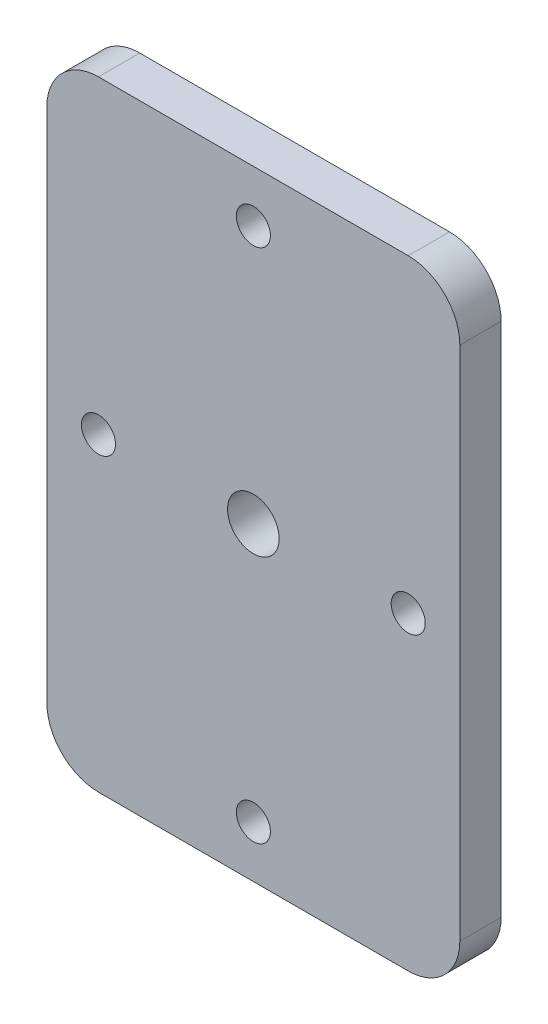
ISO-10303-21;
HEADER;
FILE_DESCRIPTION(('STEP AP214'),'2;1');
FILE_NAME('part.step','',(''),(''),'','','');
FILE_SCHEMA(('AUTOMOTIVE_DESIGN { 1 0 10303 214 1 1 1 1 }'));
ENDSEC;
DATA;
#1=APPLICATION_CONTEXT('core data for automotive mechanical design processes');
#2=APPLICATION_PROTOCOL_DEFINITION('international standard','automotive_design',2000,#1);
#3=PRODUCT_CONTEXT('',#1,'mechanical');
#4=PRODUCT('Part','Part','',(#3));
#5=PRODUCT_RELATED_PRODUCT_CATEGORY('part','',(#4));
#6=PRODUCT_DEFINITION_FORMATION('','',#4);
#7=PRODUCT_DEFINITION_CONTEXT('part definition',#1,'design');
#8=PRODUCT_DEFINITION('design','',#6,#7);
#9=PRODUCT_DEFINITION_SHAPE('','',#8);
#10=(LENGTH_UNIT() NAMED_UNIT(*) SI_UNIT(.MILLI.,.METRE.));
#11=(NAMED_UNIT(*) PLANE_ANGLE_UNIT() SI_UNIT($,.RADIAN.));
#12=(NAMED_UNIT(*) SI_UNIT($,.STERADIAN.) SOLID_ANGLE_UNIT());
#13=UNCERTAINTY_MEASURE_WITH_UNIT(LENGTH_MEASURE(1.E-05),#10,'distance_accuracy_value','');
#14=(GEOMETRIC_REPRESENTATION_CONTEXT(3) GLOBAL_UNCERTAINTY_ASSIGNED_CONTEXT((#13)) GLOBAL_UNIT_ASSIGNED_CONTEXT((#10,
#11,#12)) REPRESENTATION_CONTEXT('',''));
#15=CARTESIAN_POINT('',(0.,0.,0.));
#16=DIRECTION('',(0.,0.,1.));
#17=DIRECTION('',(1.,0.,0.));
#18=AXIS2_PLACEMENT_3D('',#15,#16,#17);
#19=CARTESIAN_POINT('',(40.,25.,4.));
#20=DIRECTION('',(0.,0.,-1.));
#21=DIRECTION('',(-1.,0.,0.));
#22=AXIS2_PLACEMENT_3D('',#19,#20,#21);
#23=CYLINDRICAL_SURFACE('',#22,5.);
#24=CARTESIAN_POINT('',(40.,25.,0.));
#25=DIRECTION('',(0.,0.,1.));
#26=DIRECTION('',(1.,0.,0.));
#27=AXIS2_PLACEMENT_3D('',#24,#25,#26);
#28=CIRCLE('',#27,5.);
#29=CARTESIAN_POINT('',(45.,25.,0.));
#30=VERTEX_POINT('',#29);
#31=CARTESIAN_POINT('',(40.,30.,0.));
#32=VERTEX_POINT('',#31);
#33=EDGE_CURVE('E127',#30,#32,#28,.T.);
#34=ORIENTED_EDGE('',*,*,#33,.T.);
#35=DIRECTION('',(0.,0.,-1.));
#36=VECTOR('',#35,1.);
#37=CARTESIAN_POINT('',(40.,30.,4.));
#38=LINE('',#37,#36);
#39=CARTESIAN_POINT('',(40.,30.,4.));
#40=VERTEX_POINT('',#39);
#41=EDGE_CURVE('E11',#40,#32,#38,.T.);
#42=ORIENTED_EDGE('',*,*,#41,.F.);
#43=CARTESIAN_POINT('',(40.,25.,4.));
#44=DIRECTION('',(0.,0.,1.));
#45=DIRECTION('',(1.,0.,0.));
#46=AXIS2_PLACEMENT_3D('',#43,#44,#45);
#47=CIRCLE('',#46,5.);
#48=CARTESIAN_POINT('',(45.,25.,4.));
#49=VERTEX_POINT('',#48);
#50=EDGE_CURVE('E142',#49,#40,#47,.T.);
#51=ORIENTED_EDGE('',*,*,#50,.F.);
#52=DIRECTION('',(0.,0.,-1.));
#53=VECTOR('',#52,1.);
#54=CARTESIAN_POINT('',(45.,25.,4.));
#55=LINE('',#54,#53);
#56=EDGE_CURVE('E123',#49,#30,#55,.T.);
#57=ORIENTED_EDGE('',*,*,#56,.T.);
#58=EDGE_LOOP('',(#34,#42,#51,#57));
#59=FACE_BOUND('',#58,.T.);
#60=ADVANCED_FACE('F31',(#59),#23,.T.);
#61=CARTESIAN_POINT('',(40.,30.,4.));
#62=DIRECTION('',(0.,-1.,0.));
#63=DIRECTION('',(0.,0.,-1.));
#64=AXIS2_PLACEMENT_3D('',#61,#62,#63);
#65=PLANE('',#64);
#66=DIRECTION('',(-1.,0.,0.));
#67=VECTOR('',#66,1.);
#68=CARTESIAN_POINT('',(40.,30.,0.));
#69=LINE('',#68,#67);
#70=CARTESIAN_POINT('',(10.,30.,0.));
#71=VERTEX_POINT('',#70);
#72=EDGE_CURVE('E130',#32,#71,#69,.T.);
#73=ORIENTED_EDGE('',*,*,#72,.T.);
#74=DIRECTION('',(0.,0.,-1.));
#75=VECTOR('',#74,1.);
#76=CARTESIAN_POINT('',(10.,30.,4.));
#77=LINE('',#76,#75);
#78=CARTESIAN_POINT('',(10.,30.,4.));
#79=VERTEX_POINT('',#78);
#80=EDGE_CURVE('E39',#79,#71,#77,.T.);
#81=ORIENTED_EDGE('',*,*,#80,.F.);
#82=DIRECTION('',(-1.,0.,0.));
#83=VECTOR('',#82,1.);
#84=CARTESIAN_POINT('',(40.,30.,4.));
#85=LINE('',#84,#83);
#86=EDGE_CURVE('E90',#40,#79,#85,.T.);
#87=ORIENTED_EDGE('',*,*,#86,.F.);
#88=ORIENTED_EDGE('',*,*,#41,.T.);
#89=EDGE_LOOP('',(#73,#81,#87,#88));
#90=FACE_BOUND('',#89,.T.);
#91=ADVANCED_FACE('F235',(#90),#65,.F.);
#92=CARTESIAN_POINT('',(10.,25.,4.));
#93=DIRECTION('',(0.,0.,-1.));
#94=DIRECTION('',(-1.,0.,0.));
#95=AXIS2_PLACEMENT_3D('',#92,#93,#94);
#96=CYLINDRICAL_SURFACE('',#95,5.);
#97=CARTESIAN_POINT('',(10.,25.,0.));
#98=DIRECTION('',(0.,0.,1.));
#99=DIRECTION('',(1.,0.,0.));
#100=AXIS2_PLACEMENT_3D('',#97,#98,#99);
#101=CIRCLE('',#100,5.);
#102=CARTESIAN_POINT('',(5.,25.,0.));
#103=VERTEX_POINT('',#102);
#104=EDGE_CURVE('E133',#71,#103,#101,.T.);
#105=ORIENTED_EDGE('',*,*,#104,.T.);
#106=DIRECTION('',(0.,0.,-1.));
#107=VECTOR('',#106,1.);
#108=CARTESIAN_POINT('',(5.,25.,4.));
#109=LINE('',#108,#107);
#110=CARTESIAN_POINT('',(5.,25.,4.));
#111=VERTEX_POINT('',#110);
#112=EDGE_CURVE('E149',#111,#103,#109,.T.);
#113=ORIENTED_EDGE('',*,*,#112,.F.);
#114=CARTESIAN_POINT('',(10.,25.,4.));
#115=DIRECTION('',(0.,0.,1.));
#116=DIRECTION('',(1.,0.,0.));
#117=AXIS2_PLACEMENT_3D('',#114,#115,#116);
#118=CIRCLE('',#117,5.);
#119=EDGE_CURVE('E157',#79,#111,#118,.T.);
#120=ORIENTED_EDGE('',*,*,#119,.F.);
#121=ORIENTED_EDGE('',*,*,#80,.T.);
#122=EDGE_LOOP('',(#105,#113,#120,#121));
#123=FACE_BOUND('',#122,.T.);
#124=ADVANCED_FACE('F155',(#123),#96,.T.);
#125=CARTESIAN_POINT('',(5.,25.,4.));
#126=DIRECTION('',(1.,0.,0.));
#127=DIRECTION('',(0.,1.,0.));
#128=AXIS2_PLACEMENT_3D('',#125,#126,#127);
#129=PLANE('',#128);
#130=DIRECTION('',(0.,-1.,0.));
#131=VECTOR('',#130,1.);
#132=CARTESIAN_POINT('',(5.,25.,0.));
#133=LINE('',#132,#131);
#134=CARTESIAN_POINT('',(5.,-25.,0.));
#135=VERTEX_POINT('',#134);
#136=EDGE_CURVE('E135',#103,#135,#133,.T.);
#137=ORIENTED_EDGE('',*,*,#136,.T.);
#138=DIRECTION('',(0.,0.,-1.));
#139=VECTOR('',#138,1.);
#140=CARTESIAN_POINT('',(5.,-25.,4.));
#141=LINE('',#140,#139);
#142=CARTESIAN_POINT('',(5.,-25.,4.));
#143=VERTEX_POINT('',#142);
#144=EDGE_CURVE('E146',#143,#135,#141,.T.);
#145=ORIENTED_EDGE('',*,*,#144,.F.);
#146=DIRECTION('',(0.,-1.,0.));
#147=VECTOR('',#146,1.);
#148=CARTESIAN_POINT('',(5.,25.,4.));
#149=LINE('',#148,#147);
#150=EDGE_CURVE('E169',#111,#143,#149,.T.);
#151=ORIENTED_EDGE('',*,*,#150,.F.);
#152=ORIENTED_EDGE('',*,*,#112,.T.);
#153=EDGE_LOOP('',(#137,#145,#151,#152));
#154=FACE_BOUND('',#153,.T.);
#155=ADVANCED_FACE('F165',(#154),#129,.F.);
#156=CARTESIAN_POINT('',(10.,-25.,4.));
#157=DIRECTION('',(0.,0.,-1.));
#158=DIRECTION('',(-1.,0.,0.));
#159=AXIS2_PLACEMENT_3D('',#156,#157,#158);
#160=CYLINDRICAL_SURFACE('',#159,5.);
#161=CARTESIAN_POINT('',(10.,-25.,0.));
#162=DIRECTION('',(0.,0.,1.));
#163=DIRECTION('',(1.,0.,0.));
#164=AXIS2_PLACEMENT_3D('',#161,#162,#163);
#165=CIRCLE('',#164,5.);
#166=CARTESIAN_POINT('',(10.,-30.,0.));
#167=VERTEX_POINT('',#166);
#168=EDGE_CURVE('E137',#135,#167,#165,.T.);
#169=ORIENTED_EDGE('',*,*,#168,.T.);
#170=DIRECTION('',(0.,0.,-1.));
#171=VECTOR('',#170,1.);
#172=CARTESIAN_POINT('',(10.,-30.,4.));
#173=LINE('',#172,#171);
#174=CARTESIAN_POINT('',(10.,-30.,4.));
#175=VERTEX_POINT('',#174);
#176=EDGE_CURVE('E118',#175,#167,#173,.T.);
#177=ORIENTED_EDGE('',*,*,#176,.F.);
#178=CARTESIAN_POINT('',(10.,-25.,4.));
#179=DIRECTION('',(0.,0.,1.));
#180=DIRECTION('',(1.,0.,0.));
#181=AXIS2_PLACEMENT_3D('',#178,#179,#180);
#182=CIRCLE('',#181,5.);
#183=EDGE_CURVE('E109',#143,#175,#182,.T.);
#184=ORIENTED_EDGE('',*,*,#183,.F.);
#185=ORIENTED_EDGE('',*,*,#144,.T.);
#186=EDGE_LOOP('',(#169,#177,#184,#185));
#187=FACE_BOUND('',#186,.T.);
#188=ADVANCED_FACE('F168',(#187),#160,.T.);
#189=CARTESIAN_POINT('',(10.,-30.,4.));
#190=DIRECTION('',(0.,1.,0.));
#191=DIRECTION('',(-1.,0.,0.));
#192=AXIS2_PLACEMENT_3D('',#189,#190,#191);
#193=PLANE('',#192);
#194=DIRECTION('',(1.,0.,0.));
#195=VECTOR('',#194,1.);
#196=CARTESIAN_POINT('',(10.,-30.,0.));
#197=LINE('',#196,#195);
#198=CARTESIAN_POINT('',(40.,-30.,0.));
#199=VERTEX_POINT('',#198);
#200=EDGE_CURVE('E117',#167,#199,#197,.T.);
#201=ORIENTED_EDGE('',*,*,#200,.T.);
#202=DIRECTION('',(0.,0.,-1.));
#203=VECTOR('',#202,1.);
#204=CARTESIAN_POINT('',(40.,-30.,4.));
#205=LINE('',#204,#203);
#206=CARTESIAN_POINT('',(40.,-30.,4.));
#207=VERTEX_POINT('',#206);
#208=EDGE_CURVE('E114',#207,#199,#205,.T.);
#209=ORIENTED_EDGE('',*,*,#208,.F.);
#210=DIRECTION('',(1.,0.,0.));
#211=VECTOR('',#210,1.);
#212=CARTESIAN_POINT('',(10.,-30.,4.));
#213=LINE('',#212,#211);
#214=EDGE_CURVE('E103',#175,#207,#213,.T.);
#215=ORIENTED_EDGE('',*,*,#214,.F.);
#216=ORIENTED_EDGE('',*,*,#176,.T.);
#217=EDGE_LOOP('',(#201,#209,#215,#216));
#218=FACE_BOUND('',#217,.T.);
#219=ADVANCED_FACE('F115',(#218),#193,.F.);
#220=CARTESIAN_POINT('',(40.,-25.,4.));
#221=DIRECTION('',(0.,0.,-1.));
#222=DIRECTION('',(-1.,0.,0.));
#223=AXIS2_PLACEMENT_3D('',#220,#221,#222);
#224=CYLINDRICAL_SURFACE('',#223,5.);
#225=CARTESIAN_POINT('',(40.,-25.,0.));
#226=DIRECTION('',(0.,0.,1.));
#227=DIRECTION('',(1.,0.,0.));
#228=AXIS2_PLACEMENT_3D('',#225,#226,#227);
#229=CIRCLE('',#228,5.);
#230=CARTESIAN_POINT('',(45.,-25.,0.));
#231=VERTEX_POINT('',#230);
#232=EDGE_CURVE('E76',#199,#231,#229,.T.);
#233=ORIENTED_EDGE('',*,*,#232,.T.);
#234=DIRECTION('',(0.,0.,-1.));
#235=VECTOR('',#234,1.);
#236=CARTESIAN_POINT('',(45.,-25.,4.));
#237=LINE('',#236,#235);
#238=CARTESIAN_POINT('',(45.,-25.,4.));
#239=VERTEX_POINT('',#238);
#240=EDGE_CURVE('E119',#239,#231,#237,.T.);
#241=ORIENTED_EDGE('',*,*,#240,.F.);
#242=CARTESIAN_POINT('',(40.,-25.,4.));
#243=DIRECTION('',(0.,0.,1.));
#244=DIRECTION('',(1.,0.,0.));
#245=AXIS2_PLACEMENT_3D('',#242,#243,#244);
#246=CIRCLE('',#245,5.);
#247=EDGE_CURVE('E107',#207,#239,#246,.T.);
#248=ORIENTED_EDGE('',*,*,#247,.F.);
#249=ORIENTED_EDGE('',*,*,#208,.T.);
#250=EDGE_LOOP('',(#233,#241,#248,#249));
#251=FACE_BOUND('',#250,.T.);
#252=ADVANCED_FACE('F121',(#251),#224,.T.);
#253=CARTESIAN_POINT('',(45.,-25.,4.));
#254=DIRECTION('',(-1.,0.,0.));
#255=DIRECTION('',(0.,0.,1.));
#256=AXIS2_PLACEMENT_3D('',#253,#254,#255);
#257=PLANE('',#256);
#258=DIRECTION('',(0.,1.,0.));
#259=VECTOR('',#258,1.);
#260=CARTESIAN_POINT('',(45.,-25.,0.));
#261=LINE('',#260,#259);
#262=EDGE_CURVE('E82',#231,#30,#261,.T.);
#263=ORIENTED_EDGE('',*,*,#262,.T.);
#264=ORIENTED_EDGE('',*,*,#56,.F.);
#265=DIRECTION('',(0.,1.,0.));
#266=VECTOR('',#265,1.);
#267=CARTESIAN_POINT('',(45.,-25.,4.));
#268=LINE('',#267,#266);
#269=EDGE_CURVE('E47',#239,#49,#268,.T.);
#270=ORIENTED_EDGE('',*,*,#269,.F.);
#271=ORIENTED_EDGE('',*,*,#240,.T.);
#272=EDGE_LOOP('',(#263,#264,#270,#271));
#273=FACE_BOUND('',#272,.T.);
#274=ADVANCED_FACE('F209',(#273),#257,.F.);
#275=CARTESIAN_POINT('',(40.,25.,4.));
#276=DIRECTION('',(0.,0.,1.));
#277=DIRECTION('',(1.,0.,0.));
#278=AXIS2_PLACEMENT_3D('',#275,#276,#277);
#279=PLANE('',#278);
#280=CARTESIAN_POINT('',(25.,0.,4.));
#281=DIRECTION('',(0.,0.,1.));
#282=DIRECTION('',(1.,0.,0.));
#283=AXIS2_PLACEMENT_3D('',#280,#281,#282);
#284=CIRCLE('',#283,2.49999999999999);
#285=CARTESIAN_POINT('',(27.5,0.,4.));
#286=VERTEX_POINT('',#285);
#287=EDGE_CURVE('E201',#286,#286,#284,.T.);
#288=ORIENTED_EDGE('',*,*,#287,.F.);
#289=EDGE_LOOP('',(#288));
#290=FACE_BOUND('',#289,.T.);
#291=CARTESIAN_POINT('',(40.,0.,4.));
#292=DIRECTION('',(0.,0.,1.));
#293=DIRECTION('',(1.,0.,0.));
#294=AXIS2_PLACEMENT_3D('',#291,#292,#293);
#295=CIRCLE('',#294,1.64999999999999);
#296=CARTESIAN_POINT('',(41.65,0.,4.));
#297=VERTEX_POINT('',#296);
#298=EDGE_CURVE('E195',#297,#297,#295,.T.);
#299=ORIENTED_EDGE('',*,*,#298,.F.);
#300=EDGE_LOOP('',(#299));
#301=FACE_BOUND('',#300,.T.);
#302=CARTESIAN_POINT('',(25.,25.,4.));
#303=DIRECTION('',(0.,0.,1.));
#304=DIRECTION('',(1.,0.,0.));
#305=AXIS2_PLACEMENT_3D('',#302,#303,#304);
#306=CIRCLE('',#305,1.64999999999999);
#307=CARTESIAN_POINT('',(26.65,25.,4.));
#308=VERTEX_POINT('',#307);
#309=EDGE_CURVE('E189',#308,#308,#306,.T.);
#310=ORIENTED_EDGE('',*,*,#309,.F.);
#311=EDGE_LOOP('',(#310));
#312=FACE_BOUND('',#311,.T.);
#313=CARTESIAN_POINT('',(25.,-25.,4.));
#314=DIRECTION('',(0.,0.,1.));
#315=DIRECTION('',(1.,0.,0.));
#316=AXIS2_PLACEMENT_3D('',#313,#314,#315);
#317=CIRCLE('',#316,1.64999999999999);
#318=CARTESIAN_POINT('',(26.65,-25.,4.));
#319=VERTEX_POINT('',#318);
#320=EDGE_CURVE('E183',#319,#319,#317,.T.);
#321=ORIENTED_EDGE('',*,*,#320,.F.);
#322=EDGE_LOOP('',(#321));
#323=FACE_BOUND('',#322,.T.);
#324=CARTESIAN_POINT('',(10.,0.,4.));
#325=DIRECTION('',(0.,0.,1.));
#326=DIRECTION('',(1.,0.,0.));
#327=AXIS2_PLACEMENT_3D('',#324,#325,#326);
#328=CIRCLE('',#327,1.64999999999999);
#329=CARTESIAN_POINT('',(11.65,0.,4.));
#330=VERTEX_POINT('',#329);
#331=EDGE_CURVE('E177',#330,#330,#328,.T.);
#332=ORIENTED_EDGE('',*,*,#331,.F.);
#333=EDGE_LOOP('',(#332));
#334=FACE_BOUND('',#333,.T.);
#335=ORIENTED_EDGE('',*,*,#50,.T.);
#336=ORIENTED_EDGE('',*,*,#86,.T.);
#337=ORIENTED_EDGE('',*,*,#119,.T.);
#338=ORIENTED_EDGE('',*,*,#150,.T.);
#339=ORIENTED_EDGE('',*,*,#183,.T.);
#340=ORIENTED_EDGE('',*,*,#214,.T.);
#341=ORIENTED_EDGE('',*,*,#247,.T.);
#342=ORIENTED_EDGE('',*,*,#269,.T.);
#343=EDGE_LOOP('',(#335,#336,#337,#338,#339,#340,#341,#342));
#344=FACE_BOUND('',#343,.T.);
#345=ADVANCED_FACE('F105',(#290,#301,#312,#323,#334,#344),#279,.T.);
#346=CARTESIAN_POINT('',(40.,25.,0.));
#347=DIRECTION('',(0.,0.,1.));
#348=DIRECTION('',(1.,0.,0.));
#349=AXIS2_PLACEMENT_3D('',#346,#347,#348);
#350=PLANE('',#349);
#351=CARTESIAN_POINT('',(25.,0.,0.));
#352=DIRECTION('',(0.,0.,1.));
#353=DIRECTION('',(1.,0.,0.));
#354=AXIS2_PLACEMENT_3D('',#351,#352,#353);
#355=CIRCLE('',#354,2.5);
#356=CARTESIAN_POINT('',(27.5,0.,0.));
#357=VERTEX_POINT('',#356);
#358=EDGE_CURVE('E198',#357,#357,#355,.T.);
#359=ORIENTED_EDGE('',*,*,#358,.T.);
#360=EDGE_LOOP('',(#359));
#361=FACE_BOUND('',#360,.T.);
#362=CARTESIAN_POINT('',(40.,0.,0.));
#363=DIRECTION('',(0.,0.,1.));
#364=DIRECTION('',(1.,0.,0.));
#365=AXIS2_PLACEMENT_3D('',#362,#363,#364);
#366=CIRCLE('',#365,1.65);
#367=CARTESIAN_POINT('',(41.65,0.,0.));
#368=VERTEX_POINT('',#367);
#369=EDGE_CURVE('E192',#368,#368,#366,.T.);
#370=ORIENTED_EDGE('',*,*,#369,.T.);
#371=EDGE_LOOP('',(#370));
#372=FACE_BOUND('',#371,.T.);
#373=CARTESIAN_POINT('',(25.,25.,0.));
#374=DIRECTION('',(0.,0.,1.));
#375=DIRECTION('',(1.,0.,0.));
#376=AXIS2_PLACEMENT_3D('',#373,#374,#375);
#377=CIRCLE('',#376,1.65);
#378=CARTESIAN_POINT('',(26.65,25.,0.));
#379=VERTEX_POINT('',#378);
#380=EDGE_CURVE('E186',#379,#379,#377,.T.);
#381=ORIENTED_EDGE('',*,*,#380,.T.);
#382=EDGE_LOOP('',(#381));
#383=FACE_BOUND('',#382,.T.);
#384=CARTESIAN_POINT('',(25.,-25.,0.));
#385=DIRECTION('',(0.,0.,1.));
#386=DIRECTION('',(1.,0.,0.));
#387=AXIS2_PLACEMENT_3D('',#384,#385,#386);
#388=CIRCLE('',#387,1.65);
#389=CARTESIAN_POINT('',(26.65,-25.,0.));
#390=VERTEX_POINT('',#389);
#391=EDGE_CURVE('E180',#390,#390,#388,.T.);
#392=ORIENTED_EDGE('',*,*,#391,.T.);
#393=EDGE_LOOP('',(#392));
#394=FACE_BOUND('',#393,.T.);
#395=CARTESIAN_POINT('',(10.,0.,0.));
#396=DIRECTION('',(0.,0.,1.));
#397=DIRECTION('',(1.,0.,0.));
#398=AXIS2_PLACEMENT_3D('',#395,#396,#397);
#399=CIRCLE('',#398,1.65);
#400=CARTESIAN_POINT('',(11.65,0.,0.));
#401=VERTEX_POINT('',#400);
#402=EDGE_CURVE('E131',#401,#401,#399,.T.);
#403=ORIENTED_EDGE('',*,*,#402,.T.);
#404=EDGE_LOOP('',(#403));
#405=FACE_BOUND('',#404,.T.);
#406=ORIENTED_EDGE('',*,*,#33,.F.);
#407=ORIENTED_EDGE('',*,*,#262,.F.);
#408=ORIENTED_EDGE('',*,*,#232,.F.);
#409=ORIENTED_EDGE('',*,*,#200,.F.);
#410=ORIENTED_EDGE('',*,*,#168,.F.);
#411=ORIENTED_EDGE('',*,*,#136,.F.);
#412=ORIENTED_EDGE('',*,*,#104,.F.);
#413=ORIENTED_EDGE('',*,*,#72,.F.);
#414=EDGE_LOOP('',(#406,#407,#408,#409,#410,#411,#412,#413));
#415=FACE_BOUND('',#414,.T.);
#416=ADVANCED_FACE('F161',(#361,#372,#383,#394,#405,#415),#350,.F.);
#417=CARTESIAN_POINT('',(10.,0.,4.));
#418=DIRECTION('',(0.,0.,1.));
#419=DIRECTION('',(1.,0.,0.));
#420=AXIS2_PLACEMENT_3D('',#417,#418,#419);
#421=CYLINDRICAL_SURFACE('',#420,1.64999999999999);
#422=ORIENTED_EDGE('',*,*,#402,.F.);
#423=EDGE_LOOP('',(#422));
#424=FACE_BOUND('',#423,.T.);
#425=ORIENTED_EDGE('',*,*,#331,.T.);
#426=EDGE_LOOP('',(#425));
#427=FACE_BOUND('',#426,.T.);
#428=ADVANCED_FACE('F219',(#424,#427),#421,.F.);
#429=CARTESIAN_POINT('',(25.,-25.,4.));
#430=DIRECTION('',(0.,0.,1.));
#431=DIRECTION('',(1.,0.,0.));
#432=AXIS2_PLACEMENT_3D('',#429,#430,#431);
#433=CYLINDRICAL_SURFACE('',#432,1.64999999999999);
#434=ORIENTED_EDGE('',*,*,#391,.F.);
#435=EDGE_LOOP('',(#434));
#436=FACE_BOUND('',#435,.T.);
#437=ORIENTED_EDGE('',*,*,#320,.T.);
#438=EDGE_LOOP('',(#437));
#439=FACE_BOUND('',#438,.T.);
#440=ADVANCED_FACE('F221',(#436,#439),#433,.F.);
#441=CARTESIAN_POINT('',(25.,25.,4.));
#442=DIRECTION('',(0.,0.,1.));
#443=DIRECTION('',(1.,0.,0.));
#444=AXIS2_PLACEMENT_3D('',#441,#442,#443);
#445=CYLINDRICAL_SURFACE('',#444,1.64999999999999);
#446=ORIENTED_EDGE('',*,*,#380,.F.);
#447=EDGE_LOOP('',(#446));
#448=FACE_BOUND('',#447,.T.);
#449=ORIENTED_EDGE('',*,*,#309,.T.);
#450=EDGE_LOOP('',(#449));
#451=FACE_BOUND('',#450,.T.);
#452=ADVANCED_FACE('F228',(#448,#451),#445,.F.);
#453=CARTESIAN_POINT('',(40.,0.,4.));
#454=DIRECTION('',(0.,0.,1.));
#455=DIRECTION('',(1.,0.,0.));
#456=AXIS2_PLACEMENT_3D('',#453,#454,#455);
#457=CYLINDRICAL_SURFACE('',#456,1.65);
#458=ORIENTED_EDGE('',*,*,#369,.F.);
#459=EDGE_LOOP('',(#458));
#460=FACE_BOUND('',#459,.T.);
#461=ORIENTED_EDGE('',*,*,#298,.T.);
#462=EDGE_LOOP('',(#461));
#463=FACE_BOUND('',#462,.T.);
#464=ADVANCED_FACE('F301',(#460,#463),#457,.F.);
#465=CARTESIAN_POINT('',(25.,0.,4.));
#466=DIRECTION('',(0.,0.,1.));
#467=DIRECTION('',(1.,0.,0.));
#468=AXIS2_PLACEMENT_3D('',#465,#466,#467);
#469=CYLINDRICAL_SURFACE('',#468,2.49999999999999);
#470=ORIENTED_EDGE('',*,*,#358,.F.);
#471=EDGE_LOOP('',(#470));
#472=FACE_BOUND('',#471,.T.);
#473=ORIENTED_EDGE('',*,*,#287,.T.);
#474=EDGE_LOOP('',(#473));
#475=FACE_BOUND('',#474,.T.);
#476=ADVANCED_FACE('F205',(#472,#475),#469,.F.);
#477=CLOSED_SHELL('',(#60,#91,#124,#155,#188,#219,#252,#274,#345,#416,#428,#440,#452,#464,#476));
#478=MANIFOLD_SOLID_BREP('B2',#477);
#479=ADVANCED_BREP_SHAPE_REPRESENTATION('',(#18,#478),#14);
#480=SHAPE_DEFINITION_REPRESENTATION(#9,#479);
ENDSEC;
END-ISO-10303-21;
